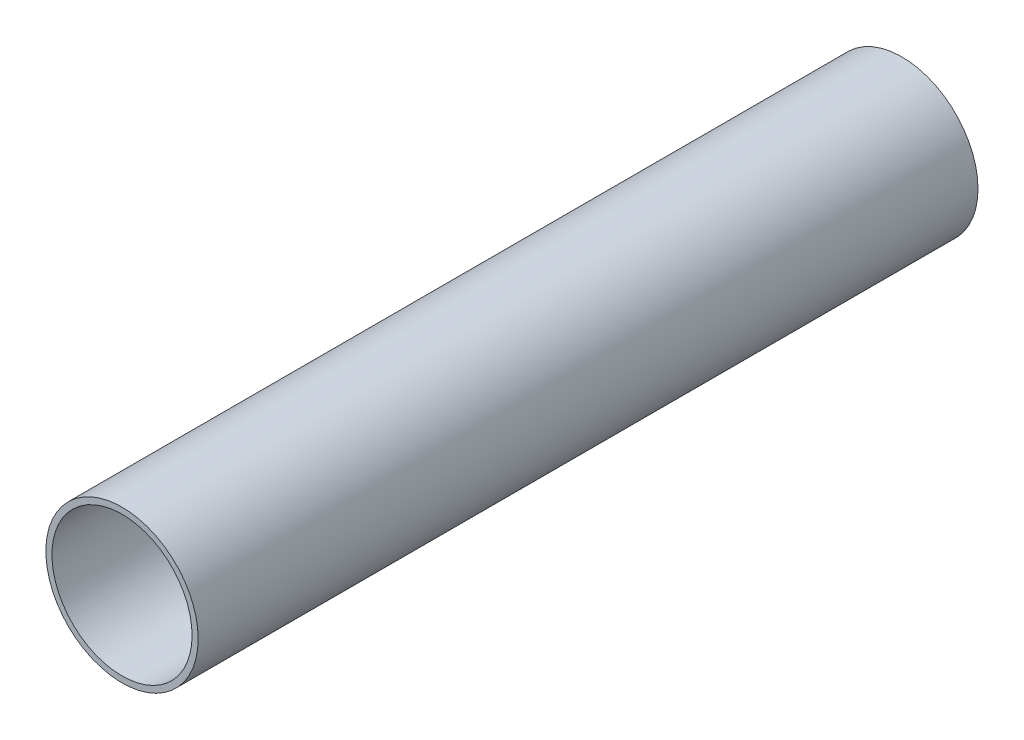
ISO-10303-21;
HEADER;
FILE_DESCRIPTION(('STEP AP214'),'2;1');
FILE_NAME('part.step','',(''),(''),'','','');
FILE_SCHEMA(('AUTOMOTIVE_DESIGN { 1 0 10303 214 1 1 1 1 }'));
ENDSEC;
DATA;
#1=APPLICATION_CONTEXT('core data for automotive mechanical design processes');
#2=APPLICATION_PROTOCOL_DEFINITION('international standard','automotive_design',2000,#1);
#3=PRODUCT_CONTEXT('',#1,'mechanical');
#4=PRODUCT('Part','Part','',(#3));
#5=PRODUCT_RELATED_PRODUCT_CATEGORY('part','',(#4));
#6=PRODUCT_DEFINITION_FORMATION('','',#4);
#7=PRODUCT_DEFINITION_CONTEXT('part definition',#1,'design');
#8=PRODUCT_DEFINITION('design','',#6,#7);
#9=PRODUCT_DEFINITION_SHAPE('','',#8);
#10=(LENGTH_UNIT() NAMED_UNIT(*) SI_UNIT(.MILLI.,.METRE.));
#11=(NAMED_UNIT(*) PLANE_ANGLE_UNIT() SI_UNIT($,.RADIAN.));
#12=(NAMED_UNIT(*) SI_UNIT($,.STERADIAN.) SOLID_ANGLE_UNIT());
#13=UNCERTAINTY_MEASURE_WITH_UNIT(LENGTH_MEASURE(1.E-05),#10,'distance_accuracy_value','');
#14=(GEOMETRIC_REPRESENTATION_CONTEXT(3) GLOBAL_UNCERTAINTY_ASSIGNED_CONTEXT((#13)) GLOBAL_UNIT_ASSIGNED_CONTEXT((#10,
#11,#12)) REPRESENTATION_CONTEXT('',''));
#15=CARTESIAN_POINT('',(0.,0.,0.));
#16=DIRECTION('',(0.,0.,1.));
#17=DIRECTION('',(1.,0.,0.));
#18=AXIS2_PLACEMENT_3D('',#15,#16,#17);
#19=CARTESIAN_POINT('',(0.,0.,-128.));
#20=DIRECTION('',(0.,0.,1.));
#21=DIRECTION('',(1.,0.,0.));
#22=AXIS2_PLACEMENT_3D('',#19,#20,#21);
#23=CYLINDRICAL_SURFACE('',#22,25.);
#24=CARTESIAN_POINT('',(0.,0.,-128.));
#25=DIRECTION('',(0.,0.,1.));
#26=DIRECTION('',(1.,0.,0.));
#27=AXIS2_PLACEMENT_3D('',#24,#25,#26);
#28=CIRCLE('',#27,25.);
#29=CARTESIAN_POINT('',(25.,0.,-128.));
#30=VERTEX_POINT('',#29);
#31=EDGE_CURVE('E10',#30,#30,#28,.T.);
#32=ORIENTED_EDGE('',*,*,#31,.T.);
#33=EDGE_LOOP('',(#32));
#34=FACE_BOUND('',#33,.T.);
#35=CARTESIAN_POINT('',(0.,0.,128.));
#36=DIRECTION('',(0.,0.,1.));
#37=DIRECTION('',(1.,0.,0.));
#38=AXIS2_PLACEMENT_3D('',#35,#36,#37);
#39=CIRCLE('',#38,25.);
#40=CARTESIAN_POINT('',(25.,0.,128.));
#41=VERTEX_POINT('',#40);
#42=EDGE_CURVE('E40',#41,#41,#39,.T.);
#43=ORIENTED_EDGE('',*,*,#42,.F.);
#44=EDGE_LOOP('',(#43));
#45=FACE_BOUND('',#44,.T.);
#46=ADVANCED_FACE('F30',(#34,#45),#23,.T.);
#47=CARTESIAN_POINT('',(0.,0.,-128.));
#48=DIRECTION('',(0.,0.,1.));
#49=DIRECTION('',(1.,0.,0.));
#50=AXIS2_PLACEMENT_3D('',#47,#48,#49);
#51=PLANE('',#50);
#52=CARTESIAN_POINT('',(0.,0.,-128.));
#53=DIRECTION('',(0.,0.,1.));
#54=DIRECTION('',(1.,0.,0.));
#55=AXIS2_PLACEMENT_3D('',#52,#53,#54);
#56=CIRCLE('',#55,23.);
#57=CARTESIAN_POINT('',(23.,0.,-128.));
#58=VERTEX_POINT('',#57);
#59=EDGE_CURVE('E36',#58,#58,#56,.T.);
#60=ORIENTED_EDGE('',*,*,#59,.T.);
#61=EDGE_LOOP('',(#60));
#62=FACE_BOUND('',#61,.T.);
#63=ORIENTED_EDGE('',*,*,#31,.F.);
#64=EDGE_LOOP('',(#63));
#65=FACE_BOUND('',#64,.T.);
#66=ADVANCED_FACE('F59',(#62,#65),#51,.F.);
#67=CARTESIAN_POINT('',(0.,0.,-128.));
#68=DIRECTION('',(0.,0.,1.));
#69=DIRECTION('',(1.,0.,0.));
#70=AXIS2_PLACEMENT_3D('',#67,#68,#69);
#71=CYLINDRICAL_SURFACE('',#70,23.);
#72=ORIENTED_EDGE('',*,*,#59,.F.);
#73=EDGE_LOOP('',(#72));
#74=FACE_BOUND('',#73,.T.);
#75=CARTESIAN_POINT('',(0.,0.,128.));
#76=DIRECTION('',(0.,0.,1.));
#77=DIRECTION('',(1.,0.,0.));
#78=AXIS2_PLACEMENT_3D('',#75,#76,#77);
#79=CIRCLE('',#78,23.);
#80=CARTESIAN_POINT('',(23.,0.,128.));
#81=VERTEX_POINT('',#80);
#82=EDGE_CURVE('E44',#81,#81,#79,.T.);
#83=ORIENTED_EDGE('',*,*,#82,.T.);
#84=EDGE_LOOP('',(#83));
#85=FACE_BOUND('',#84,.T.);
#86=ADVANCED_FACE('F50',(#74,#85),#71,.F.);
#87=CARTESIAN_POINT('',(0.,0.,128.));
#88=DIRECTION('',(0.,0.,1.));
#89=DIRECTION('',(1.,0.,0.));
#90=AXIS2_PLACEMENT_3D('',#87,#88,#89);
#91=PLANE('',#90);
#92=ORIENTED_EDGE('',*,*,#42,.T.);
#93=EDGE_LOOP('',(#92));
#94=FACE_BOUND('',#93,.T.);
#95=ORIENTED_EDGE('',*,*,#82,.F.);
#96=EDGE_LOOP('',(#95));
#97=FACE_BOUND('',#96,.T.);
#98=ADVANCED_FACE('F52',(#94,#97),#91,.T.);
#99=CLOSED_SHELL('',(#46,#66,#86,#98));
#100=MANIFOLD_SOLID_BREP('B2',#99);
#101=ADVANCED_BREP_SHAPE_REPRESENTATION('',(#18,#100),#14);
#102=SHAPE_DEFINITION_REPRESENTATION(#9,#101);
ENDSEC;
END-ISO-10303-21;
